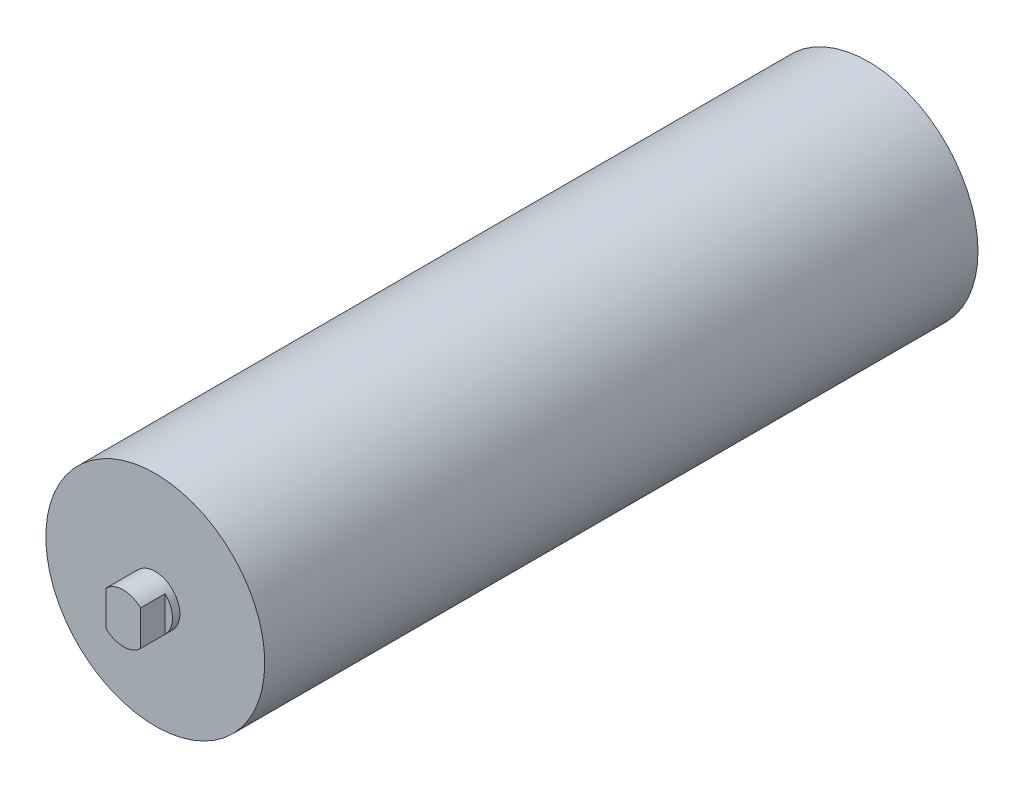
from build123d import *

# Parameters (mm, degrees)
ESQUISSE1_R             = 44.5
BASE_EXTRUSION_DEPTH    = 290
ESQUISSE2_R             = 10
BOSS_EXTRU_1_DEPTH      = 13
BOSS_EXTRU_2_START      = 13
ESQUISSE3_R             = 10
BOSS_EXTRU_2_DEPTH      = 13
ESQUISSE5_OUTSIDE_W     = 159.028
ESQUISSE5_OUTSIDE_H     = 159.028
ESQUISSE5_OUTSIDE_W_2   = 14
ESQUISSE5_OUTSIDE_H_2   = 37.599051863
ENL_V_MAT_EXTRU_1_DEPTH = 10
ESQUISSE6_OUTSIDE_W     = 159.028
ESQUISSE6_OUTSIDE_H     = 159.028
ESQUISSE6_OUTSIDE_W_2   = 14
ESQUISSE6_OUTSIDE_H_2   = 39.851078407
ENL_V_MAT_EXTRU_2_DEPTH = 10


with BuildPart() as part:
    # Esquisse1 → Base-Extrusion (new body)
    with BuildSketch(Plane.XY):
        Circle(ESQUISSE1_R)
    extrude(amount=BASE_EXTRUSION_DEPTH)

    # Esquisse2 → Boss.-Extru.1 (add)
    with BuildSketch(Plane.XY.offset(290)):
        with Locations(Location((0, 0, 0), (0, 0, 134.427004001))):
            Circle(ESQUISSE2_R)
    extrude(amount=BOSS_EXTRU_1_DEPTH)

    # Esquisse3 → Boss.-Extru.2 (add)
    with BuildSketch(Plane(origin=(0, 0, 0), x_dir=(-1, 0, 0), z_dir=(0, 0, -1)).offset(BOSS_EXTRU_2_START)):
        with Locations(Location((0, 0, 0), (0, 0, 45.572995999))):
            Circle(ESQUISSE3_R)
    extrude(amount=-BOSS_EXTRU_2_DEPTH)

    # Esquisse5 outside → Enl_v. mat.-Extru.1 (cut)
    with BuildSketch(Plane(origin=(0, 0, -13), x_dir=(-1, 0, 0), z_dir=(0, 0, -1))):
        Rectangle(ESQUISSE5_OUTSIDE_W, ESQUISSE5_OUTSIDE_H)
        with Locations((0, 1.468712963)):
            Rectangle(ESQUISSE5_OUTSIDE_W_2, ESQUISSE5_OUTSIDE_H_2, mode=Mode.SUBTRACT)
    extrude(amount=-ENL_V_MAT_EXTRU_1_DEPTH, mode=Mode.SUBTRACT)

    # Esquisse6 outside → Enl_v. mat.-Extru.2 (cut)
    with BuildSketch(Plane.XY.offset(303)):
        Rectangle(ESQUISSE6_OUTSIDE_W, ESQUISSE6_OUTSIDE_H)
        with Locations((0, -0.146871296)):
            Rectangle(ESQUISSE6_OUTSIDE_W_2, ESQUISSE6_OUTSIDE_H_2, mode=Mode.SUBTRACT)
    extrude(amount=-ENL_V_MAT_EXTRU_2_DEPTH, mode=Mode.SUBTRACT)


solid = part.part
